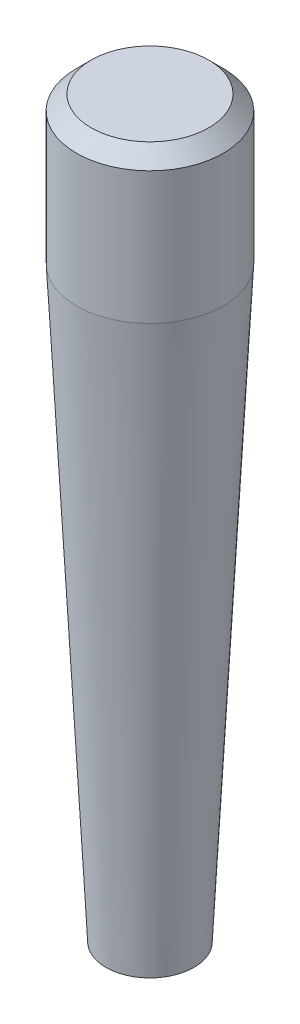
from build123d import *

# Parameters (mm, degrees)
CHAMFER1_SIZE = 1


with BuildPart() as part:
    # Sketch1 → Revolve1 (revolve)
    with BuildSketch(Plane.XY):
        Polygon((0, 0), (0, -50), (-3, -50), (-5, -10), (-5, 0), align=None)
    revolve(axis=Axis((0, 0, 0), (0, -1, 0)))

    # Chamfer1
    chamfer1_edges = [part.edges().sort_by_distance(p)[0] for p in [
        (5, 0, 0),
    ]]
    chamfer(chamfer1_edges, length=CHAMFER1_SIZE)


solid = part.part
